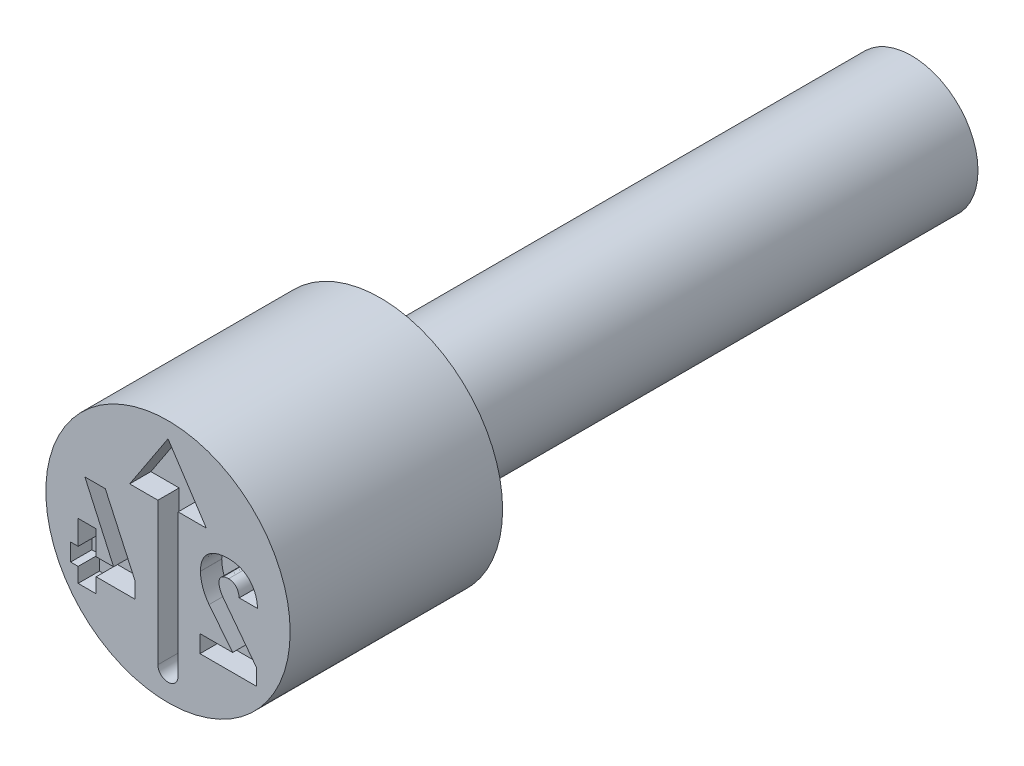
from build123d import *

# Parameters (mm, degrees)
CUT_EXTRUDE4_DEPTH = 0.4
SKETCH4_W          = 0.339311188
SKETCH4_H          = 1.059751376
CUT_EXTRUDE5_DEPTH = 0.4


with BuildPart() as part:
    # Sketch2 → Revolve1 (revolve)
    with BuildSketch(Plane(origin=(0, 0, 0), x_dir=(0, 0, -1), z_dir=(1, 0, 0)), mode=Mode.PRIVATE) as revolve1_sk:
        Polygon((0, 2.3), (0, 0), (14, 0), (14, 1.25), (4, 1.25), (4, 2.3), align=None)
    revolve(revolve1_sk.sketch.rotate(Axis((0, 0, -0.403888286), (0, 0, -1)), 90), axis=Axis((0, 0, -0.403888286), (0, 0, -1)))

    # Sketch3 → Cut-Extrude4 (cut)
    with BuildSketch(Plane.XY):
        with BuildLine():
            Line((0.190473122, 0.906351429), (0.190473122, -1.776161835))
            ThreePointArc((0.190473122, -1.776161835), (0, -1.966634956), (-0.190473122, -1.776161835))
            Line((-0.190473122, -1.776161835), (-0.190473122, 0.906351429))
            Line((-0.190473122, 0.906351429), (-0.721917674, 0.906351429))
            Line((-0.721917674, 0.906351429), (0, 2.002115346))
            Line((0, 2.002115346), (0.721917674, 0.906351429))
            Line((0.721917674, 0.906351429), (0.190473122, 0.906351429))
        make_face()
    extrude(amount=-CUT_EXTRUDE4_DEPTH, mode=Mode.SUBTRACT)

    # Sketch4 → Cut-Extrude5 (cut)
    with BuildSketch(Plane.XY):
        with BuildLine():
            Line((1.666109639, -0.894069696), (1.048379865, -0.081923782))
            add(Edge.make_bspline(
                [(1.048379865, -0.081923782), (1.035424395, -0.063949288), (1.010132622, -0.028859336), (0.9875043, 0.019539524), (0.973129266, 0.057489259), (0.966483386, 0.085017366), (0.961563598, 0.111340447), (0.960990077, 0.128611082), (0.960709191, 0.137069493)],
                knots=[0, 0, 0, 0, 1.660423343, 3.241491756, 3.993801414, 4.704207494, 5.365376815, 6, 6, 6, 6], degree=3))
            Line((0.960709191, 0.137069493), (0.960709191, 0.139637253))
            add(Edge.make_bspline(
                [(0.960709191, 0.139637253), (0.961201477, 0.151195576), (0.962139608, 0.173221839), (0.971196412, 0.204210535), (0.986172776, 0.231007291), (1.007150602, 0.253470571), (1.033834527, 0.27073464), (1.065309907, 0.28334591), (1.10174401, 0.29048152), (1.127582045, 0.291390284), (1.141186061, 0.291868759)],
                knots=[0, 0, 0, 0, 1.033361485, 1.969238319, 2.861873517, 3.760870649, 4.693536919, 5.686153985, 6.781734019, 8, 8, 8, 8], degree=3))
            add(Edge.make_bspline(
                [(1.141186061, 0.291868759), (1.15458203, 0.291302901), (1.180579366, 0.29020475), (1.217560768, 0.279740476), (1.2504126, 0.261975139), (1.278851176, 0.237423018), (1.302713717, 0.206536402), (1.320302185, 0.169328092), (1.334466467, 0.12703926), (1.33857692, 0.0963466), (1.340737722, 0.080211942)],
                knots=[0, 0, 0, 0, 0.993701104, 1.928459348, 2.826878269, 3.748294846, 4.700551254, 5.70417143, 6.793118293, 8, 8, 8, 8], degree=3))
            Line((1.340737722, 0.080211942), (1.340737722, 0.07874465))
            Line((1.340737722, 0.07874465), (1.688485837, 0.07874465))
            Line((1.688485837, 0.07874465), (1.688485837, 0.080211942))
            add(Edge.make_bspline(
                [(1.688485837, 0.080211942), (1.685994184, 0.107310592), (1.681140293, 0.160100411), (1.66463569, 0.236016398), (1.640253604, 0.305870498), (1.609102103, 0.369855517), (1.57090493, 0.427163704), (1.526584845, 0.477779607), (1.475650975, 0.520720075), (1.418985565, 0.556401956), (1.356836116, 0.584326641), (1.289962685, 0.604672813), (1.218264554, 0.616402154), (1.168985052, 0.617927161), (1.143753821, 0.618707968)],
                knots=[0, 0, 0, 0, 1.143950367, 2.228484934, 3.258162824, 4.249580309, 5.213917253, 6.146796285, 7.070112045, 8.006232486, 8.954636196, 9.927630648, 10.9389416, 12, 12, 12, 12], degree=3))
            add(Edge.make_bspline(
                [(1.143753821, 0.618707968), (1.116697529, 0.61814235), (1.064331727, 0.617047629), (0.988928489, 0.606742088), (0.919593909, 0.589592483), (0.856501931, 0.565497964), (0.800066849, 0.534525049), (0.75002748, 0.497760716), (0.707796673, 0.45377777), (0.672668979, 0.403812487), (0.644977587, 0.348057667), (0.625585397, 0.286561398), (0.613709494, 0.219817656), (0.612247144, 0.173435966), (0.611493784, 0.149541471)],
                knots=[0, 0, 0, 0, 1.208591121, 2.339154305, 3.392741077, 4.394302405, 5.348037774, 6.261656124, 7.158186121, 8.060194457, 8.981460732, 9.928425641, 10.932785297, 12, 12, 12, 12], degree=3))
            Line((0.611493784, 0.149541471), (0.611493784, 0.14807418))
            add(Edge.make_bspline(
                [(0.611493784, 0.14807418), (0.611964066, 0.127628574), (0.612905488, 0.086700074), (0.621301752, 0.025554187), (0.63503089, -0.035238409), (0.653659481, -0.095464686), (0.676921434, -0.15411899), (0.704682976, -0.210266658), (0.736378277, -0.263764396), (0.761214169, -0.296849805), (0.773629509, -0.313389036)],
                knots=[0, 0, 0, 0, 0.985191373, 1.972179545, 2.968870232, 3.986806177, 5.007996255, 6.007036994, 7.003727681, 8, 8, 8, 8], degree=3))
            Line((0.773629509, -0.313389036), (1.216751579, -0.873160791))
            Line((1.216751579, -0.873160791), (0.601589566, -0.873160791))
            Line((0.601589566, -0.873160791), (0.601589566, -1.2))
            Line((0.601589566, -1.2), (1.666109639, -1.2))
            Line((1.666109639, -1.2), (1.666109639, -0.894069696))
        make_face()
        Polygon((-0.625770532, -0.611982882), (-1.180406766, 0.598899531), (-1.564470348, 0.598899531), (-1.024507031, -0.596943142), (-1.832984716, -0.596943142), (-1.832984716, -0.923782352), (-0.625770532, -0.923782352), align=None)
        with Locations((-1.522102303, -0.671224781)):
            Rectangle(SKETCH4_W, SKETCH4_H)
    extrude(amount=-CUT_EXTRUDE5_DEPTH, mode=Mode.SUBTRACT)


solid = part.part
